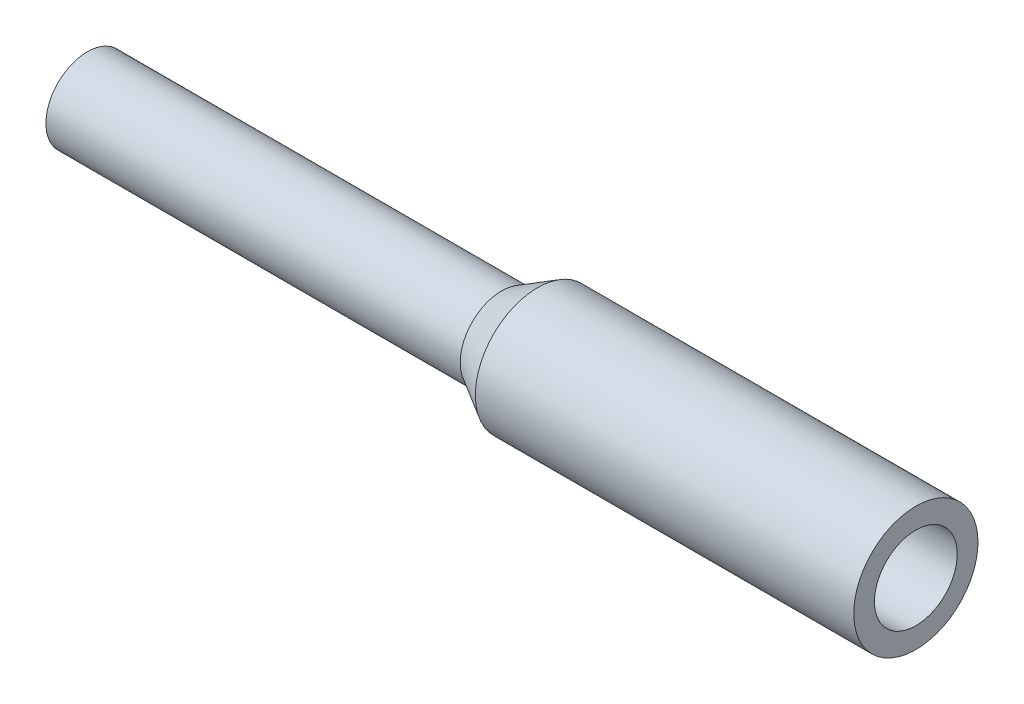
ISO-10303-21;
HEADER;
FILE_DESCRIPTION(('STEP AP214'),'2;1');
FILE_NAME('part.step','',(''),(''),'','','');
FILE_SCHEMA(('AUTOMOTIVE_DESIGN { 1 0 10303 214 1 1 1 1 }'));
ENDSEC;
DATA;
#1=APPLICATION_CONTEXT('core data for automotive mechanical design processes');
#2=APPLICATION_PROTOCOL_DEFINITION('international standard','automotive_design',2000,#1);
#3=PRODUCT_CONTEXT('',#1,'mechanical');
#4=PRODUCT('Part','Part','',(#3));
#5=PRODUCT_RELATED_PRODUCT_CATEGORY('part','',(#4));
#6=PRODUCT_DEFINITION_FORMATION('','',#4);
#7=PRODUCT_DEFINITION_CONTEXT('part definition',#1,'design');
#8=PRODUCT_DEFINITION('design','',#6,#7);
#9=PRODUCT_DEFINITION_SHAPE('','',#8);
#10=(LENGTH_UNIT() NAMED_UNIT(*) SI_UNIT(.MILLI.,.METRE.));
#11=(NAMED_UNIT(*) PLANE_ANGLE_UNIT() SI_UNIT($,.RADIAN.));
#12=(NAMED_UNIT(*) SI_UNIT($,.STERADIAN.) SOLID_ANGLE_UNIT());
#13=UNCERTAINTY_MEASURE_WITH_UNIT(LENGTH_MEASURE(1.E-05),#10,'distance_accuracy_value','');
#14=(GEOMETRIC_REPRESENTATION_CONTEXT(3) GLOBAL_UNCERTAINTY_ASSIGNED_CONTEXT((#13)) GLOBAL_UNIT_ASSIGNED_CONTEXT((#10,
#11,#12)) REPRESENTATION_CONTEXT('',''));
#15=CARTESIAN_POINT('',(0.,0.,0.));
#16=DIRECTION('',(0.,0.,1.));
#17=DIRECTION('',(1.,0.,0.));
#18=AXIS2_PLACEMENT_3D('',#15,#16,#17);
#19=CARTESIAN_POINT('',(0.,2.24999999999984,0.));
#20=DIRECTION('',(1.,0.,0.));
#21=DIRECTION('',(0.,0.,-1.));
#22=AXIS2_PLACEMENT_3D('',#19,#20,#21);
#23=PLANE('',#22);
#24=CARTESIAN_POINT('',(0.,0.,0.));
#25=DIRECTION('',(1.,0.,0.));
#26=DIRECTION('',(0.,0.,-1.));
#27=AXIS2_PLACEMENT_3D('',#24,#25,#26);
#28=CIRCLE('',#27,2.25);
#29=CARTESIAN_POINT('',(0.,0.,-2.25000000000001));
#30=VERTEX_POINT('',#29);
#31=EDGE_CURVE('E63',#30,#30,#28,.T.);
#32=ORIENTED_EDGE('',*,*,#31,.T.);
#33=EDGE_LOOP('',(#32));
#34=FACE_BOUND('',#33,.T.);
#35=CARTESIAN_POINT('',(0.,0.,0.));
#36=DIRECTION('',(1.,0.,0.));
#37=DIRECTION('',(0.,0.,-1.));
#38=AXIS2_PLACEMENT_3D('',#35,#36,#37);
#39=CIRCLE('',#38,1.5);
#40=CARTESIAN_POINT('',(0.,0.,-1.5));
#41=VERTEX_POINT('',#40);
#42=EDGE_CURVE('E11',#41,#41,#39,.T.);
#43=ORIENTED_EDGE('',*,*,#42,.F.);
#44=EDGE_LOOP('',(#43));
#45=FACE_BOUND('',#44,.T.);
#46=ADVANCED_FACE('F32',(#34,#45),#23,.T.);
#47=CARTESIAN_POINT('',(0.,0.,0.));
#48=DIRECTION('',(1.,0.,0.));
#49=DIRECTION('',(0.,0.,-1.));
#50=AXIS2_PLACEMENT_3D('',#47,#48,#49);
#51=CYLINDRICAL_SURFACE('',#50,1.5);
#52=CARTESIAN_POINT('',(-11.9999999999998,-2.08166817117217E-13,1.11022302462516E-13));
#53=DIRECTION('',(1.,0.,0.));
#54=DIRECTION('',(0.,0.,-1.));
#55=AXIS2_PLACEMENT_3D('',#52,#53,#54);
#56=CIRCLE('',#55,1.5);
#57=CARTESIAN_POINT('',(-11.9999999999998,0.,-1.5));
#58=VERTEX_POINT('',#57);
#59=EDGE_CURVE('E38',#58,#58,#56,.T.);
#60=CARTESIAN_POINT('',(0.,0.,-1.5));
#61=CARTESIAN_POINT('',(-0.124999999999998,0.,-1.5));
#62=CARTESIAN_POINT('',(-0.249999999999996,0.,-1.5));
#63=CARTESIAN_POINT('',(-0.499999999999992,0.,-1.5));
#64=CARTESIAN_POINT('',(-0.62499999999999,0.,-1.5));
#65=CARTESIAN_POINT('',(-0.874999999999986,0.,-1.5));
#66=CARTESIAN_POINT('',(-0.999999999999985,0.,-1.5));
#67=CARTESIAN_POINT('',(-1.24999999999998,0.,-1.5));
#68=CARTESIAN_POINT('',(-1.37499999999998,0.,-1.5));
#69=CARTESIAN_POINT('',(-1.62499999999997,0.,-1.5));
#70=CARTESIAN_POINT('',(-1.74999999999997,0.,-1.5));
#71=CARTESIAN_POINT('',(-1.99999999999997,0.,-1.5));
#72=CARTESIAN_POINT('',(-2.12499999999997,0.,-1.5));
#73=CARTESIAN_POINT('',(-2.37499999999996,0.,-1.5));
#74=CARTESIAN_POINT('',(-2.49999999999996,0.,-1.5));
#75=CARTESIAN_POINT('',(-2.74999999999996,0.,-1.5));
#76=CARTESIAN_POINT('',(-2.87499999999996,0.,-1.5));
#77=CARTESIAN_POINT('',(-3.12499999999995,0.,-1.5));
#78=CARTESIAN_POINT('',(-3.24999999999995,0.,-1.5));
#79=CARTESIAN_POINT('',(-3.49999999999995,0.,-1.5));
#80=CARTESIAN_POINT('',(-3.62499999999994,0.,-1.5));
#81=CARTESIAN_POINT('',(-3.87499999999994,0.,-1.5));
#82=CARTESIAN_POINT('',(-3.99999999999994,0.,-1.5));
#83=CARTESIAN_POINT('',(-4.24999999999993,0.,-1.5));
#84=CARTESIAN_POINT('',(-4.37499999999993,0.,-1.5));
#85=CARTESIAN_POINT('',(-4.62499999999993,0.,-1.5));
#86=CARTESIAN_POINT('',(-4.74999999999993,0.,-1.5));
#87=CARTESIAN_POINT('',(-4.99999999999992,0.,-1.5));
#88=CARTESIAN_POINT('',(-5.12499999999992,0.,-1.5));
#89=CARTESIAN_POINT('',(-5.37499999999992,0.,-1.5));
#90=CARTESIAN_POINT('',(-5.49999999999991,0.,-1.5));
#91=CARTESIAN_POINT('',(-5.74999999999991,0.,-1.5));
#92=CARTESIAN_POINT('',(-5.87499999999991,0.,-1.5));
#93=CARTESIAN_POINT('',(-6.12499999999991,0.,-1.5));
#94=CARTESIAN_POINT('',(-6.2499999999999,0.,-1.5));
#95=CARTESIAN_POINT('',(-6.4999999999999,0.,-1.5));
#96=CARTESIAN_POINT('',(-6.6249999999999,0.,-1.5));
#97=CARTESIAN_POINT('',(-6.87499999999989,0.,-1.5));
#98=CARTESIAN_POINT('',(-6.99999999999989,0.,-1.5));
#99=CARTESIAN_POINT('',(-7.24999999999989,0.,-1.5));
#100=CARTESIAN_POINT('',(-7.37499999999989,0.,-1.5));
#101=CARTESIAN_POINT('',(-7.62499999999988,0.,-1.5));
#102=CARTESIAN_POINT('',(-7.74999999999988,0.,-1.5));
#103=CARTESIAN_POINT('',(-7.99999999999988,0.,-1.5));
#104=CARTESIAN_POINT('',(-8.12499999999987,0.,-1.5));
#105=CARTESIAN_POINT('',(-8.37499999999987,0.,-1.5));
#106=CARTESIAN_POINT('',(-8.49999999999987,0.,-1.5));
#107=CARTESIAN_POINT('',(-8.74999999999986,0.,-1.5));
#108=CARTESIAN_POINT('',(-8.87499999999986,0.,-1.5));
#109=CARTESIAN_POINT('',(-9.12499999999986,0.,-1.5));
#110=CARTESIAN_POINT('',(-9.24999999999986,0.,-1.5));
#111=CARTESIAN_POINT('',(-9.49999999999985,0.,-1.5));
#112=CARTESIAN_POINT('',(-9.62499999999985,0.,-1.5));
#113=CARTESIAN_POINT('',(-9.87499999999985,0.,-1.5));
#114=CARTESIAN_POINT('',(-9.99999999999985,0.,-1.5));
#115=CARTESIAN_POINT('',(-10.2499999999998,0.,-1.5));
#116=CARTESIAN_POINT('',(-10.3749999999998,0.,-1.5));
#117=CARTESIAN_POINT('',(-10.6249999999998,0.,-1.5));
#118=CARTESIAN_POINT('',(-10.7499999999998,0.,-1.5));
#119=CARTESIAN_POINT('',(-10.9999999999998,0.,-1.5));
#120=CARTESIAN_POINT('',(-11.1249999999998,0.,-1.5));
#121=CARTESIAN_POINT('',(-11.3749999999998,0.,-1.5));
#122=CARTESIAN_POINT('',(-11.4999999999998,0.,-1.5));
#123=CARTESIAN_POINT('',(-11.7499999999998,0.,-1.5));
#124=CARTESIAN_POINT('',(-11.8749999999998,0.,-1.5));
#125=CARTESIAN_POINT('',(-11.9999999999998,0.,-1.5));
#126=B_SPLINE_CURVE_WITH_KNOTS('',3,(#60,#61,#62,#63,#64,#65,#66,#67,#68,#69,#70,#71,#72,#73,
#74,#75,#76,#77,#78,#79,#80,#81,#82,#83,#84,#85,#86,#87,#88,#89,#90,#91,#92,#93,#94,#95,#96,#97,
#98,#99,#100,#101,#102,#103,#104,#105,#106,#107,#108,#109,#110,#111,#112,#113,#114,#115,#116,
#117,#118,#119,#120,#121,#122,#123,#124,#125),.UNSPECIFIED.,.F.,.F.,(4,2,2,2,2,2,2,2,2,2,2,2,2,
2,2,2,2,2,2,2,2,2,2,2,2,2,2,2,2,2,2,2,4),(0.,0.374999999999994,0.749999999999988,
1.12499999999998,1.49999999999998,1.87499999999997,2.24999999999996,2.62499999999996,
2.99999999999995,3.37499999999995,3.74999999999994,4.12499999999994,4.49999999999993,
4.87499999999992,5.24999999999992,5.62499999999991,5.99999999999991,6.3749999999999,
6.7499999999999,7.12499999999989,7.49999999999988,7.87499999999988,8.24999999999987,
8.62499999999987,8.99999999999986,9.37499999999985,9.74999999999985,10.1249999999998,
10.4999999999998,10.8749999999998,11.2499999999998,11.6249999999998,11.9999999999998),.UNSPECIFIED.);
#127=EDGE_CURVE('BSEAM44',#41,#58,#126,.T.);
#128=ORIENTED_EDGE('',*,*,#42,.T.);
#129=ORIENTED_EDGE('',*,*,#59,.F.);
#130=ORIENTED_EDGE('',*,*,#127,.T.);
#131=ORIENTED_EDGE('',*,*,#127,.F.);
#132=EDGE_LOOP('',(#128,#130,#129,#131));
#133=FACE_BOUND('',#132,.T.);
#134=ADVANCED_FACE('F44',(#133),#51,.F.);
#135=CARTESIAN_POINT('',(-12.9012909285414,-1.52655665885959E-13,1.66533453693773E-13));
#136=DIRECTION('',(1.,0.,0.));
#137=DIRECTION('',(0.,0.,-1.));
#138=AXIS2_PLACEMENT_3D('',#135,#136,#137);
#139=CONICAL_SURFACE('',#138,0.,1.02974425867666);
#140=ORIENTED_EDGE('',*,*,#59,.T.);
#141=EDGE_LOOP('',(#140));
#142=FACE_BOUND('',#141,.T.);
#143=CARTESIAN_POINT('',(-12.9012909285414,-1.52655665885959E-13,1.66533453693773E-13));
#144=VERTEX_POINT('',#143);
#145=VERTEX_LOOP('',#144);
#146=FACE_BOUND('',#145,.T.);
#147=ADVANCED_FACE('F41',(#142,#146),#139,.F.);
#148=CARTESIAN_POINT('',(-30.0000000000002,-1.52655665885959E-13,2.22044604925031E-13));
#149=DIRECTION('',(-1.,0.,0.));
#150=DIRECTION('',(0.,0.,1.));
#151=AXIS2_PLACEMENT_3D('',#148,#149,#150);
#152=PLANE('',#151);
#153=CARTESIAN_POINT('',(-30.0000000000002,-1.52655665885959E-13,2.22044604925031E-13));
#154=DIRECTION('',(1.,0.,0.));
#155=DIRECTION('',(0.,0.,-1.));
#156=AXIS2_PLACEMENT_3D('',#153,#154,#155);
#157=CIRCLE('',#156,1.5);
#158=CARTESIAN_POINT('',(-30.0000000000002,0.,-1.5));
#159=VERTEX_POINT('',#158);
#160=EDGE_CURVE('E67',#159,#159,#157,.T.);
#161=ORIENTED_EDGE('',*,*,#160,.F.);
#162=EDGE_LOOP('',(#161));
#163=FACE_BOUND('',#162,.T.);
#164=ADVANCED_FACE('F43',(#163),#152,.T.);
#165=CARTESIAN_POINT('',(0.,0.,0.));
#166=DIRECTION('',(1.,0.,0.));
#167=DIRECTION('',(0.,0.,-1.));
#168=AXIS2_PLACEMENT_3D('',#165,#166,#167);
#169=CYLINDRICAL_SURFACE('',#168,1.5);
#170=CARTESIAN_POINT('',(-15.,-1.52655665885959E-13,2.22044604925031E-13));
#171=DIRECTION('',(1.,0.,0.));
#172=DIRECTION('',(0.,0.,-1.));
#173=AXIS2_PLACEMENT_3D('',#170,#171,#172);
#174=CIRCLE('',#173,1.5);
#175=CARTESIAN_POINT('',(-15.,0.,-1.5));
#176=VERTEX_POINT('',#175);
#177=EDGE_CURVE('E69',#176,#176,#174,.T.);
#178=CARTESIAN_POINT('',(-30.0000000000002,0.,-1.5));
#179=CARTESIAN_POINT('',(-29.8437500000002,0.,-1.5));
#180=CARTESIAN_POINT('',(-29.6875000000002,0.,-1.5));
#181=CARTESIAN_POINT('',(-29.3750000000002,0.,-1.5));
#182=CARTESIAN_POINT('',(-29.2187500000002,0.,-1.5));
#183=CARTESIAN_POINT('',(-28.9062500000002,0.,-1.5));
#184=CARTESIAN_POINT('',(-28.7500000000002,0.,-1.5));
#185=CARTESIAN_POINT('',(-28.4375000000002,0.,-1.5));
#186=CARTESIAN_POINT('',(-28.2812500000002,0.,-1.5));
#187=CARTESIAN_POINT('',(-27.9687500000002,0.,-1.5));
#188=CARTESIAN_POINT('',(-27.8125000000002,0.,-1.5));
#189=CARTESIAN_POINT('',(-27.5000000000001,0.,-1.5));
#190=CARTESIAN_POINT('',(-27.3437500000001,0.,-1.5));
#191=CARTESIAN_POINT('',(-27.0312500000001,0.,-1.5));
#192=CARTESIAN_POINT('',(-26.8750000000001,0.,-1.5));
#193=CARTESIAN_POINT('',(-26.5625000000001,0.,-1.5));
#194=CARTESIAN_POINT('',(-26.4062500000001,0.,-1.5));
#195=CARTESIAN_POINT('',(-26.0937500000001,0.,-1.5));
#196=CARTESIAN_POINT('',(-25.9375000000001,0.,-1.5));
#197=CARTESIAN_POINT('',(-25.6250000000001,0.,-1.5));
#198=CARTESIAN_POINT('',(-25.4687500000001,0.,-1.5));
#199=CARTESIAN_POINT('',(-25.1562500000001,0.,-1.5));
#200=CARTESIAN_POINT('',(-25.0000000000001,0.,-1.5));
#201=CARTESIAN_POINT('',(-24.6875000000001,0.,-1.5));
#202=CARTESIAN_POINT('',(-24.5312500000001,0.,-1.5));
#203=CARTESIAN_POINT('',(-24.2187500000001,0.,-1.5));
#204=CARTESIAN_POINT('',(-24.0625000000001,0.,-1.5));
#205=CARTESIAN_POINT('',(-23.7500000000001,0.,-1.5));
#206=CARTESIAN_POINT('',(-23.5937500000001,0.,-1.5));
#207=CARTESIAN_POINT('',(-23.2812500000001,0.,-1.5));
#208=CARTESIAN_POINT('',(-23.1250000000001,0.,-1.5));
#209=CARTESIAN_POINT('',(-22.8125000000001,0.,-1.5));
#210=CARTESIAN_POINT('',(-22.6562500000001,0.,-1.5));
#211=CARTESIAN_POINT('',(-22.3437500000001,0.,-1.5));
#212=CARTESIAN_POINT('',(-22.1875000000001,0.,-1.5));
#213=CARTESIAN_POINT('',(-21.8750000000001,0.,-1.5));
#214=CARTESIAN_POINT('',(-21.7187500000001,0.,-1.5));
#215=CARTESIAN_POINT('',(-21.4062500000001,0.,-1.5));
#216=CARTESIAN_POINT('',(-21.2500000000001,0.,-1.5));
#217=CARTESIAN_POINT('',(-20.9375,0.,-1.5));
#218=CARTESIAN_POINT('',(-20.78125,0.,-1.5));
#219=CARTESIAN_POINT('',(-20.46875,0.,-1.5));
#220=CARTESIAN_POINT('',(-20.3125,0.,-1.5));
#221=CARTESIAN_POINT('',(-20.,0.,-1.5));
#222=CARTESIAN_POINT('',(-19.84375,0.,-1.5));
#223=CARTESIAN_POINT('',(-19.53125,0.,-1.5));
#224=CARTESIAN_POINT('',(-19.375,0.,-1.5));
#225=CARTESIAN_POINT('',(-19.0625,0.,-1.5));
#226=CARTESIAN_POINT('',(-18.90625,0.,-1.5));
#227=CARTESIAN_POINT('',(-18.59375,0.,-1.5));
#228=CARTESIAN_POINT('',(-18.4375,0.,-1.5));
#229=CARTESIAN_POINT('',(-18.125,0.,-1.5));
#230=CARTESIAN_POINT('',(-17.96875,0.,-1.5));
#231=CARTESIAN_POINT('',(-17.65625,0.,-1.5));
#232=CARTESIAN_POINT('',(-17.5,0.,-1.5));
#233=CARTESIAN_POINT('',(-17.1875,0.,-1.5));
#234=CARTESIAN_POINT('',(-17.03125,0.,-1.5));
#235=CARTESIAN_POINT('',(-16.71875,0.,-1.5));
#236=CARTESIAN_POINT('',(-16.5625,0.,-1.5));
#237=CARTESIAN_POINT('',(-16.25,0.,-1.5));
#238=CARTESIAN_POINT('',(-16.09375,0.,-1.5));
#239=CARTESIAN_POINT('',(-15.78125,0.,-1.5));
#240=CARTESIAN_POINT('',(-15.625,0.,-1.5));
#241=CARTESIAN_POINT('',(-15.3125,0.,-1.5));
#242=CARTESIAN_POINT('',(-15.15625,0.,-1.5));
#243=CARTESIAN_POINT('',(-15.,0.,-1.5));
#244=B_SPLINE_CURVE_WITH_KNOTS('',3,(#178,#179,#180,#181,#182,#183,#184,#185,#186,#187,#188,
#189,#190,#191,#192,#193,#194,#195,#196,#197,#198,#199,#200,#201,#202,#203,#204,#205,#206,#207,
#208,#209,#210,#211,#212,#213,#214,#215,#216,#217,#218,#219,#220,#221,#222,#223,#224,#225,#226,
#227,#228,#229,#230,#231,#232,#233,#234,#235,#236,#237,#238,#239,#240,#241,#242,#243),
.UNSPECIFIED.,.F.,.F.,(4,2,2,2,2,2,2,2,2,2,2,2,2,2,2,2,2,2,2,2,2,2,2,2,2,2,2,2,2,2,2,2,4),(0.,
0.468750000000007,0.937500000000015,1.40625000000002,1.87500000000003,2.34375000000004,
2.81250000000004,3.28125000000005,3.75000000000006,4.21875000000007,4.68750000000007,
5.15625000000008,5.62500000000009,6.0937500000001,6.5625000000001,7.03125000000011,
7.50000000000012,7.96875000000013,8.43750000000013,8.90625000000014,9.37500000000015,
9.84375000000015,10.3125000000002,10.7812500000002,11.2500000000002,11.7187500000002,
12.1875000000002,12.6562500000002,13.1250000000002,13.5937500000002,14.0625000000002,
14.5312500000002,15.0000000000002),.UNSPECIFIED.);
#245=EDGE_CURVE('BSEAM51',#159,#176,#244,.T.);
#246=ORIENTED_EDGE('',*,*,#160,.T.);
#247=ORIENTED_EDGE('',*,*,#177,.F.);
#248=ORIENTED_EDGE('',*,*,#245,.T.);
#249=ORIENTED_EDGE('',*,*,#245,.F.);
#250=EDGE_LOOP('',(#246,#248,#247,#249));
#251=FACE_BOUND('',#250,.T.);
#252=ADVANCED_FACE('F51',(#251),#169,.T.);
#253=CARTESIAN_POINT('',(-13.7009618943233,-1.52655665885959E-13,1.66533453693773E-13));
#254=DIRECTION('',(1.,0.,0.));
#255=DIRECTION('',(0.,0.,-1.));
#256=AXIS2_PLACEMENT_3D('',#253,#254,#255);
#257=CONICAL_SURFACE('',#256,2.25,0.5235987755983);
#258=CARTESIAN_POINT('',(-13.7009618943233,-1.52655665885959E-13,1.66533453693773E-13));
#259=DIRECTION('',(1.,0.,0.));
#260=DIRECTION('',(0.,0.,-1.));
#261=AXIS2_PLACEMENT_3D('',#258,#259,#260);
#262=CIRCLE('',#261,2.25);
#263=CARTESIAN_POINT('',(-13.7009618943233,-1.51344214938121E-13,-2.24999999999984));
#264=VERTEX_POINT('',#263);
#265=EDGE_CURVE('E74',#264,#264,#262,.T.);
#266=CARTESIAN_POINT('',(-15.,-1.51645983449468E-13,-1.49999999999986));
#267=CARTESIAN_POINT('',(-14.9864683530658,-1.51642840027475E-13,-1.50781249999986));
#268=CARTESIAN_POINT('',(-14.9729367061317,-1.51639696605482E-13,-1.51562499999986));
#269=CARTESIAN_POINT('',(-14.9458734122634,-1.51633409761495E-13,-1.53124999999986));
#270=CARTESIAN_POINT('',(-14.9323417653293,-1.51630266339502E-13,-1.53906249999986));
#271=CARTESIAN_POINT('',(-14.905278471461,-1.51623979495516E-13,-1.55468749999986));
#272=CARTESIAN_POINT('',(-14.8917468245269,-1.51620836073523E-13,-1.56249999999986));
#273=CARTESIAN_POINT('',(-14.8646835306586,-1.51614549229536E-13,-1.57812499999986));
#274=CARTESIAN_POINT('',(-14.8511518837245,-1.51611405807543E-13,-1.58593749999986));
#275=CARTESIAN_POINT('',(-14.8240885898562,-1.51605118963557E-13,-1.60156249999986));
#276=CARTESIAN_POINT('',(-14.8105569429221,-1.51601975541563E-13,-1.60937499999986));
#277=CARTESIAN_POINT('',(-14.7834936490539,-1.51595688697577E-13,-1.62499999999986));
#278=CARTESIAN_POINT('',(-14.7699620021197,-1.51592545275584E-13,-1.63281249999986));
#279=CARTESIAN_POINT('',(-14.7428987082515,-1.51586258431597E-13,-1.64843749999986));
#280=CARTESIAN_POINT('',(-14.7293670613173,-1.51583115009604E-13,-1.65624999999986));
#281=CARTESIAN_POINT('',(-14.7023037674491,-1.51576828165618E-13,-1.67187499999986));
#282=CARTESIAN_POINT('',(-14.6887721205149,-1.51573684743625E-13,-1.67968749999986));
#283=CARTESIAN_POINT('',(-14.6617088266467,-1.51567397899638E-13,-1.69531249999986));
#284=CARTESIAN_POINT('',(-14.6481771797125,-1.51564254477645E-13,-1.70312499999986));
#285=CARTESIAN_POINT('',(-14.6211138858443,-1.51557967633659E-13,-1.71874999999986));
#286=CARTESIAN_POINT('',(-14.6075822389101,-1.51554824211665E-13,-1.72656249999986));
#287=CARTESIAN_POINT('',(-14.5805189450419,-1.51548537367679E-13,-1.74218749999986));
#288=CARTESIAN_POINT('',(-14.5669872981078,-1.51545393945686E-13,-1.74999999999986));
#289=CARTESIAN_POINT('',(-14.5399240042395,-1.51539107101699E-13,-1.76562499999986));
#290=CARTESIAN_POINT('',(-14.5263923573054,-1.51535963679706E-13,-1.77343749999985));
#291=CARTESIAN_POINT('',(-14.4993290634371,-1.5152967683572E-13,-1.78906249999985));
#292=CARTESIAN_POINT('',(-14.485797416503,-1.51526533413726E-13,-1.79687499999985));
#293=CARTESIAN_POINT('',(-14.4587341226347,-1.5152024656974E-13,-1.81249999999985));
#294=CARTESIAN_POINT('',(-14.4452024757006,-1.51517103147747E-13,-1.82031249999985));
#295=CARTESIAN_POINT('',(-14.4181391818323,-1.5151081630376E-13,-1.83593749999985));
#296=CARTESIAN_POINT('',(-14.4046075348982,-1.51507672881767E-13,-1.84374999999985));
#297=CARTESIAN_POINT('',(-14.3775442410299,-1.51501386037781E-13,-1.85937499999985));
#298=CARTESIAN_POINT('',(-14.3640125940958,-1.51498242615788E-13,-1.86718749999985));
#299=CARTESIAN_POINT('',(-14.3369493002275,-1.51491955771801E-13,-1.88281249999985));
#300=CARTESIAN_POINT('',(-14.3234176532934,-1.51488812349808E-13,-1.89062499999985));
#301=CARTESIAN_POINT('',(-14.2963543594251,-1.51482525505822E-13,-1.90624999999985));
#302=CARTESIAN_POINT('',(-14.282822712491,-1.51479382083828E-13,-1.91406249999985));
#303=CARTESIAN_POINT('',(-14.2557594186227,-1.51473095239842E-13,-1.92968749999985));
#304=CARTESIAN_POINT('',(-14.2422277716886,-1.51469951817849E-13,-1.93749999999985));
#305=CARTESIAN_POINT('',(-14.2151644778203,-1.51463664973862E-13,-1.95312499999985));
#306=CARTESIAN_POINT('',(-14.2016328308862,-1.51460521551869E-13,-1.96093749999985));
#307=CARTESIAN_POINT('',(-14.1745695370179,-1.51454234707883E-13,-1.97656249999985));
#308=CARTESIAN_POINT('',(-14.1610378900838,-1.5145109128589E-13,-1.98437499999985));
#309=CARTESIAN_POINT('',(-14.1339745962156,-1.51444804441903E-13,-1.99999999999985));
#310=CARTESIAN_POINT('',(-14.1204429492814,-1.5144166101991E-13,-2.00781249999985));
#311=CARTESIAN_POINT('',(-14.0933796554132,-1.51435374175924E-13,-2.02343749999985));
#312=CARTESIAN_POINT('',(-14.079848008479,-1.5143223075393E-13,-2.03124999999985));
#313=CARTESIAN_POINT('',(-14.0527847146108,-1.51425943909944E-13,-2.04687499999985));
#314=CARTESIAN_POINT('',(-14.0392530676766,-1.51422800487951E-13,-2.05468749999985));
#315=CARTESIAN_POINT('',(-14.0121897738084,-1.51416513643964E-13,-2.07031249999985));
#316=CARTESIAN_POINT('',(-13.9986581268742,-1.51413370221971E-13,-2.07812499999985));
#317=CARTESIAN_POINT('',(-13.971594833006,-1.51407083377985E-13,-2.09374999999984));
#318=CARTESIAN_POINT('',(-13.9580631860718,-1.51403939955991E-13,-2.10156249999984));
#319=CARTESIAN_POINT('',(-13.9309998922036,-1.51397653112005E-13,-2.11718749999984));
#320=CARTESIAN_POINT('',(-13.9174682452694,-1.51394509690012E-13,-2.12499999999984));
#321=CARTESIAN_POINT('',(-13.8904049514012,-1.51388222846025E-13,-2.14062499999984));
#322=CARTESIAN_POINT('',(-13.8768733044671,-1.51385079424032E-13,-2.14843749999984));
#323=CARTESIAN_POINT('',(-13.8498100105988,-1.51378792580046E-13,-2.16406249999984));
#324=CARTESIAN_POINT('',(-13.8362783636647,-1.51375649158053E-13,-2.17187499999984));
#325=CARTESIAN_POINT('',(-13.8092150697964,-1.51369362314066E-13,-2.18749999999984));
#326=CARTESIAN_POINT('',(-13.7956834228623,-1.51366218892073E-13,-2.19531249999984));
#327=CARTESIAN_POINT('',(-13.768620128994,-1.51359932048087E-13,-2.21093749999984));
#328=CARTESIAN_POINT('',(-13.7550884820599,-1.51356788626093E-13,-2.21874999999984));
#329=CARTESIAN_POINT('',(-13.7280251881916,-1.51350501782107E-13,-2.23437499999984));
#330=CARTESIAN_POINT('',(-13.7144935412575,-1.51347358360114E-13,-2.24218749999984));
#331=CARTESIAN_POINT('',(-13.7009618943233,-1.51344214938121E-13,-2.24999999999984));
#332=B_SPLINE_CURVE_WITH_KNOTS('',3,(#266,#267,#268,#269,#270,#271,#272,#273,#274,#275,#276,
#277,#278,#279,#280,#281,#282,#283,#284,#285,#286,#287,#288,#289,#290,#291,#292,#293,#294,#295,
#296,#297,#298,#299,#300,#301,#302,#303,#304,#305,#306,#307,#308,#309,#310,#311,#312,#313,#314,
#315,#316,#317,#318,#319,#320,#321,#322,#323,#324,#325,#326,#327,#328,#329,#330,#331),
.UNSPECIFIED.,.F.,.F.,(4,2,2,2,2,2,2,2,2,2,2,2,2,2,2,2,2,2,2,2,2,2,2,2,2,2,2,2,2,2,2,2,4),(0.,
0.0468749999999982,0.0937499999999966,0.140624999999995,0.187499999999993,0.234374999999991,
0.28124999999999,0.328124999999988,0.374999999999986,0.421874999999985,0.468749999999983,
0.515624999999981,0.562499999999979,0.609374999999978,0.656249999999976,0.703124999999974,
0.749999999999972,0.796874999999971,0.843749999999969,0.890624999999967,0.937499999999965,
0.984374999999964,1.03124999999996,1.07812499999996,1.12499999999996,1.17187499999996,
1.21874999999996,1.26562499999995,1.31249999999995,1.35937499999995,1.40624999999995,
1.45312499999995,1.49999999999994),.UNSPECIFIED.);
#333=EDGE_CURVE('BSEAM82',#176,#264,#332,.T.);
#334=ORIENTED_EDGE('',*,*,#177,.T.);
#335=ORIENTED_EDGE('',*,*,#265,.F.);
#336=ORIENTED_EDGE('',*,*,#333,.T.);
#337=ORIENTED_EDGE('',*,*,#333,.F.);
#338=EDGE_LOOP('',(#334,#336,#335,#337));
#339=FACE_BOUND('',#338,.T.);
#340=ADVANCED_FACE('F82',(#339),#257,.T.);
#341=CARTESIAN_POINT('',(0.,0.,0.));
#342=DIRECTION('',(1.,0.,0.));
#343=DIRECTION('',(0.,0.,-1.));
#344=AXIS2_PLACEMENT_3D('',#341,#342,#343);
#345=CYLINDRICAL_SURFACE('',#344,2.25);
#346=CARTESIAN_POINT('',(-13.7009618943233,0.,-2.25000000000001));
#347=CARTESIAN_POINT('',(-13.5582435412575,0.,-2.25000000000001));
#348=CARTESIAN_POINT('',(-13.4155251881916,0.,-2.25000000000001));
#349=CARTESIAN_POINT('',(-13.1300884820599,0.,-2.25000000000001));
#350=CARTESIAN_POINT('',(-12.987370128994,0.,-2.25000000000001));
#351=CARTESIAN_POINT('',(-12.7019334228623,0.,-2.25000000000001));
#352=CARTESIAN_POINT('',(-12.5592150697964,0.,-2.25000000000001));
#353=CARTESIAN_POINT('',(-12.2737783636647,0.,-2.25000000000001));
#354=CARTESIAN_POINT('',(-12.1310600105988,0.,-2.25000000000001));
#355=CARTESIAN_POINT('',(-11.8456233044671,0.,-2.25000000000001));
#356=CARTESIAN_POINT('',(-11.7029049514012,0.,-2.25000000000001));
#357=CARTESIAN_POINT('',(-11.4174682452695,0.,-2.25000000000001));
#358=CARTESIAN_POINT('',(-11.2747498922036,0.,-2.25000000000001));
#359=CARTESIAN_POINT('',(-10.9893131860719,0.,-2.25000000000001));
#360=CARTESIAN_POINT('',(-10.846594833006,0.,-2.25000000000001));
#361=CARTESIAN_POINT('',(-10.5611581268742,0.,-2.25000000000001));
#362=CARTESIAN_POINT('',(-10.4184397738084,0.,-2.25000000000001));
#363=CARTESIAN_POINT('',(-10.1330030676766,0.,-2.25000000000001));
#364=CARTESIAN_POINT('',(-9.99028471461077,0.,-2.25000000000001));
#365=CARTESIAN_POINT('',(-9.70484800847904,0.,-2.25000000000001));
#366=CARTESIAN_POINT('',(-9.56212965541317,0.,-2.25000000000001));
#367=CARTESIAN_POINT('',(-9.27669294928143,0.,-2.25000000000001));
#368=CARTESIAN_POINT('',(-9.13397459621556,0.,-2.25000000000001));
#369=CARTESIAN_POINT('',(-8.84853789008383,0.,-2.25000000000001));
#370=CARTESIAN_POINT('',(-8.70581953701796,0.,-2.25000000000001));
#371=CARTESIAN_POINT('',(-8.42038283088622,0.,-2.25000000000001));
#372=CARTESIAN_POINT('',(-8.27766447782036,0.,-2.25000000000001));
#373=CARTESIAN_POINT('',(-7.99222777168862,0.,-2.25000000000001));
#374=CARTESIAN_POINT('',(-7.84950941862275,0.,-2.25000000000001));
#375=CARTESIAN_POINT('',(-7.56407271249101,0.,-2.25000000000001));
#376=CARTESIAN_POINT('',(-7.42135435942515,0.,-2.25000000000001));
#377=CARTESIAN_POINT('',(-7.13591765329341,0.,-2.25000000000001));
#378=CARTESIAN_POINT('',(-6.99319930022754,0.,-2.25000000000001));
#379=CARTESIAN_POINT('',(-6.70776259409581,0.,-2.25000000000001));
#380=CARTESIAN_POINT('',(-6.56504424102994,0.,-2.25000000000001));
#381=CARTESIAN_POINT('',(-6.2796075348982,0.,-2.25000000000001));
#382=CARTESIAN_POINT('',(-6.13688918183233,0.,-2.25000000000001));
#383=CARTESIAN_POINT('',(-5.8514524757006,0.,-2.25000000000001));
#384=CARTESIAN_POINT('',(-5.70873412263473,0.,-2.25000000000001));
#385=CARTESIAN_POINT('',(-5.42329741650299,0.,-2.25000000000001));
#386=CARTESIAN_POINT('',(-5.28057906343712,0.,-2.25000000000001));
#387=CARTESIAN_POINT('',(-4.99514235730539,0.,-2.25000000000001));
#388=CARTESIAN_POINT('',(-4.85242400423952,0.,-2.25000000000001));
#389=CARTESIAN_POINT('',(-4.56698729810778,0.,-2.25000000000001));
#390=CARTESIAN_POINT('',(-4.42426894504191,0.,-2.25000000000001));
#391=CARTESIAN_POINT('',(-4.13883223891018,0.,-2.25000000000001));
#392=CARTESIAN_POINT('',(-3.99611388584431,0.,-2.25000000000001));
#393=CARTESIAN_POINT('',(-3.71067717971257,0.,-2.25000000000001));
#394=CARTESIAN_POINT('',(-3.56795882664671,0.,-2.25000000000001));
#395=CARTESIAN_POINT('',(-3.28252212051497,0.,-2.25000000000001));
#396=CARTESIAN_POINT('',(-3.1398037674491,0.,-2.25000000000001));
#397=CARTESIAN_POINT('',(-2.85436706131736,0.,-2.25000000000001));
#398=CARTESIAN_POINT('',(-2.7116487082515,0.,-2.25000000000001));
#399=CARTESIAN_POINT('',(-2.42621200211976,0.,-2.25000000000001));
#400=CARTESIAN_POINT('',(-2.28349364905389,0.,-2.25000000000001));
#401=CARTESIAN_POINT('',(-1.99805694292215,0.,-2.25000000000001));
#402=CARTESIAN_POINT('',(-1.85533858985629,0.,-2.25000000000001));
#403=CARTESIAN_POINT('',(-1.56990188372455,0.,-2.25000000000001));
#404=CARTESIAN_POINT('',(-1.42718353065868,0.,-2.25000000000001));
#405=CARTESIAN_POINT('',(-1.14174682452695,0.,-2.25000000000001));
#406=CARTESIAN_POINT('',(-0.999028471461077,0.,-2.25000000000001));
#407=CARTESIAN_POINT('',(-0.713591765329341,0.,-2.25000000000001));
#408=CARTESIAN_POINT('',(-0.570873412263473,0.,-2.25000000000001));
#409=CARTESIAN_POINT('',(-0.285436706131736,0.,-2.25000000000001));
#410=CARTESIAN_POINT('',(-0.142718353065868,0.,-2.25000000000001));
#411=CARTESIAN_POINT('',(0.,0.,-2.25000000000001));
#412=B_SPLINE_CURVE_WITH_KNOTS('',3,(#346,#347,#348,#349,#350,#351,#352,#353,#354,#355,#356,
#357,#358,#359,#360,#361,#362,#363,#364,#365,#366,#367,#368,#369,#370,#371,#372,#373,#374,#375,
#376,#377,#378,#379,#380,#381,#382,#383,#384,#385,#386,#387,#388,#389,#390,#391,#392,#393,#394,
#395,#396,#397,#398,#399,#400,#401,#402,#403,#404,#405,#406,#407,#408,#409,#410,#411),
.UNSPECIFIED.,.F.,.F.,(4,2,2,2,2,2,2,2,2,2,2,2,2,2,2,2,2,2,2,2,2,2,2,2,2,2,2,2,2,2,2,2,4),(0.,
0.428155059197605,0.856310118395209,1.28446517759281,1.71262023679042,2.14077529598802,
2.56893035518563,2.99708541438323,3.42524047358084,3.85339553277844,4.28155059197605,
4.70970565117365,5.13786071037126,5.56601576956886,5.99417082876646,6.42232588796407,
6.85048094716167,7.27863600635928,7.70679106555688,8.13494612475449,8.56310118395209,
8.9912562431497,9.4194113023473,9.84756636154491,10.2757214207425,10.7038764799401,
11.1320315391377,11.5601865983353,11.9883416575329,12.4164967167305,12.8446517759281,
13.2728068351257,13.7009618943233),.UNSPECIFIED.);
#413=EDGE_CURVE('BSEAM79',#264,#30,#412,.T.);
#414=ORIENTED_EDGE('',*,*,#265,.T.);
#415=ORIENTED_EDGE('',*,*,#31,.F.);
#416=ORIENTED_EDGE('',*,*,#413,.T.);
#417=ORIENTED_EDGE('',*,*,#413,.F.);
#418=EDGE_LOOP('',(#414,#416,#415,#417));
#419=FACE_BOUND('',#418,.T.);
#420=ADVANCED_FACE('F79',(#419),#345,.T.);
#421=CLOSED_SHELL('',(#46,#134,#147,#164,#252,#340,#420));
#422=MANIFOLD_SOLID_BREP('B2',#421);
#423=ADVANCED_BREP_SHAPE_REPRESENTATION('',(#18,#422),#14);
#424=SHAPE_DEFINITION_REPRESENTATION(#9,#423);
ENDSEC;
END-ISO-10303-21;
